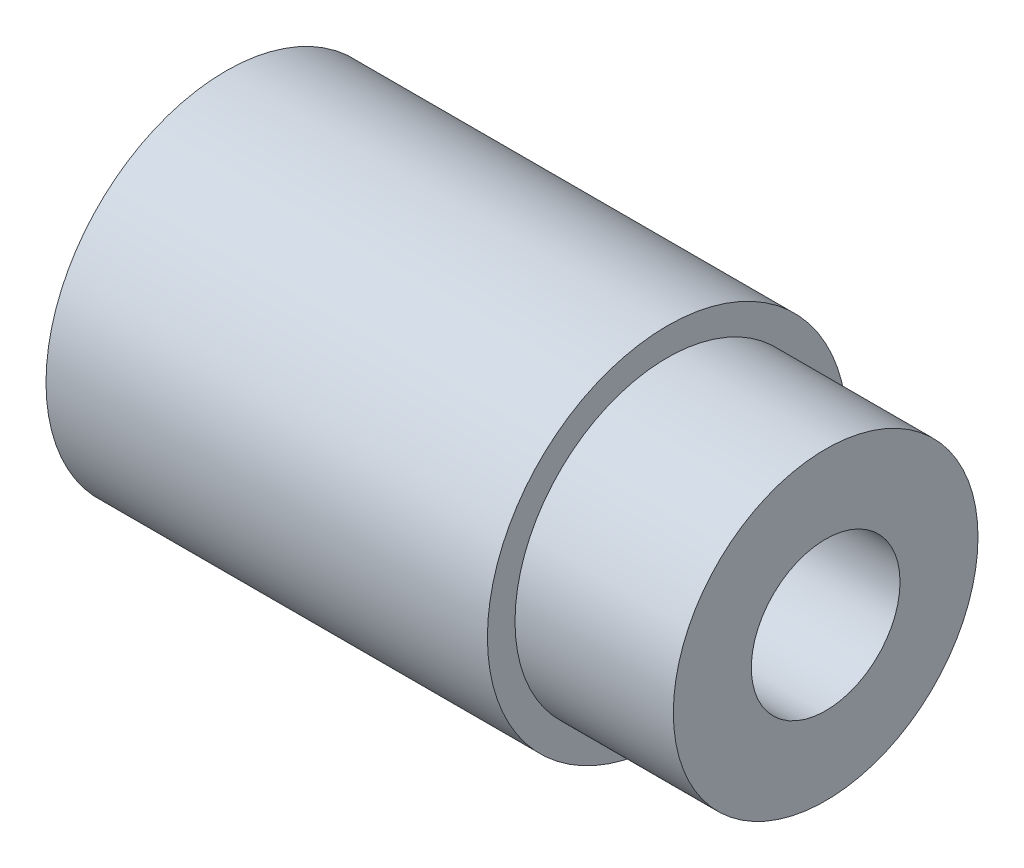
ISO-10303-21;
HEADER;
FILE_DESCRIPTION(('STEP AP214'),'2;1');
FILE_NAME('part.step','',(''),(''),'','','');
FILE_SCHEMA(('AUTOMOTIVE_DESIGN { 1 0 10303 214 1 1 1 1 }'));
ENDSEC;
DATA;
#1=APPLICATION_CONTEXT('core data for automotive mechanical design processes');
#2=APPLICATION_PROTOCOL_DEFINITION('international standard','automotive_design',2000,#1);
#3=PRODUCT_CONTEXT('',#1,'mechanical');
#4=PRODUCT('Part','Part','',(#3));
#5=PRODUCT_RELATED_PRODUCT_CATEGORY('part','',(#4));
#6=PRODUCT_DEFINITION_FORMATION('','',#4);
#7=PRODUCT_DEFINITION_CONTEXT('part definition',#1,'design');
#8=PRODUCT_DEFINITION('design','',#6,#7);
#9=PRODUCT_DEFINITION_SHAPE('','',#8);
#10=(LENGTH_UNIT() NAMED_UNIT(*) SI_UNIT(.MILLI.,.METRE.));
#11=(NAMED_UNIT(*) PLANE_ANGLE_UNIT() SI_UNIT($,.RADIAN.));
#12=(NAMED_UNIT(*) SI_UNIT($,.STERADIAN.) SOLID_ANGLE_UNIT());
#13=UNCERTAINTY_MEASURE_WITH_UNIT(LENGTH_MEASURE(1.E-05),#10,'distance_accuracy_value','');
#14=(GEOMETRIC_REPRESENTATION_CONTEXT(3) GLOBAL_UNCERTAINTY_ASSIGNED_CONTEXT((#13)) GLOBAL_UNIT_ASSIGNED_CONTEXT((#10,
#11,#12)) REPRESENTATION_CONTEXT('',''));
#15=CARTESIAN_POINT('',(0.,0.,0.));
#16=DIRECTION('',(0.,0.,1.));
#17=DIRECTION('',(1.,0.,0.));
#18=AXIS2_PLACEMENT_3D('',#15,#16,#17);
#19=CARTESIAN_POINT('',(-25.,0.,0.));
#20=DIRECTION('',(1.,0.,0.));
#21=DIRECTION('',(0.,0.,-1.));
#22=AXIS2_PLACEMENT_3D('',#19,#20,#21);
#23=CYLINDRICAL_SURFACE('',#22,7.5);
#24=CARTESIAN_POINT('',(-25.,0.,0.));
#25=DIRECTION('',(1.,0.,0.));
#26=DIRECTION('',(0.,0.,-1.));
#27=AXIS2_PLACEMENT_3D('',#24,#25,#26);
#28=CIRCLE('',#27,7.5);
#29=CARTESIAN_POINT('',(-25.,0.,-7.5));
#30=VERTEX_POINT('',#29);
#31=EDGE_CURVE('E11',#30,#30,#28,.T.);
#32=CARTESIAN_POINT('',(-6.6,0.,0.));
#33=DIRECTION('',(0.999999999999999,0.,0.));
#34=DIRECTION('',(0.,0.,-1.));
#35=AXIS2_PLACEMENT_3D('',#32,#33,#34);
#36=CIRCLE('',#35,7.5);
#37=CARTESIAN_POINT('',(-6.6,0.,-7.5));
#38=VERTEX_POINT('',#37);
#39=EDGE_CURVE('E28',#38,#38,#36,.F.);
#40=CARTESIAN_POINT('',(-25.,0.,-7.5));
#41=CARTESIAN_POINT('',(-24.8083333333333,0.,-7.5));
#42=CARTESIAN_POINT('',(-24.6166666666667,0.,-7.5));
#43=CARTESIAN_POINT('',(-24.2333333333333,0.,-7.5));
#44=CARTESIAN_POINT('',(-24.0416666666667,0.,-7.5));
#45=CARTESIAN_POINT('',(-23.6583333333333,0.,-7.5));
#46=CARTESIAN_POINT('',(-23.4666666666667,0.,-7.5));
#47=CARTESIAN_POINT('',(-23.0833333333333,0.,-7.5));
#48=CARTESIAN_POINT('',(-22.8916666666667,0.,-7.5));
#49=CARTESIAN_POINT('',(-22.5083333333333,0.,-7.5));
#50=CARTESIAN_POINT('',(-22.3166666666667,0.,-7.5));
#51=CARTESIAN_POINT('',(-21.9333333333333,0.,-7.5));
#52=CARTESIAN_POINT('',(-21.7416666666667,0.,-7.5));
#53=CARTESIAN_POINT('',(-21.3583333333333,0.,-7.5));
#54=CARTESIAN_POINT('',(-21.1666666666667,0.,-7.5));
#55=CARTESIAN_POINT('',(-20.7833333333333,0.,-7.5));
#56=CARTESIAN_POINT('',(-20.5916666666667,0.,-7.5));
#57=CARTESIAN_POINT('',(-20.2083333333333,0.,-7.5));
#58=CARTESIAN_POINT('',(-20.0166666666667,0.,-7.5));
#59=CARTESIAN_POINT('',(-19.6333333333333,0.,-7.5));
#60=CARTESIAN_POINT('',(-19.4416666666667,0.,-7.5));
#61=CARTESIAN_POINT('',(-19.0583333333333,0.,-7.5));
#62=CARTESIAN_POINT('',(-18.8666666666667,0.,-7.5));
#63=CARTESIAN_POINT('',(-18.4833333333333,0.,-7.5));
#64=CARTESIAN_POINT('',(-18.2916666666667,0.,-7.5));
#65=CARTESIAN_POINT('',(-17.9083333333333,0.,-7.5));
#66=CARTESIAN_POINT('',(-17.7166666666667,0.,-7.5));
#67=CARTESIAN_POINT('',(-17.3333333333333,0.,-7.5));
#68=CARTESIAN_POINT('',(-17.1416666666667,0.,-7.5));
#69=CARTESIAN_POINT('',(-16.7583333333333,0.,-7.5));
#70=CARTESIAN_POINT('',(-16.5666666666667,0.,-7.5));
#71=CARTESIAN_POINT('',(-16.1833333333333,0.,-7.5));
#72=CARTESIAN_POINT('',(-15.9916666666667,0.,-7.5));
#73=CARTESIAN_POINT('',(-15.6083333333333,0.,-7.5));
#74=CARTESIAN_POINT('',(-15.4166666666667,0.,-7.5));
#75=CARTESIAN_POINT('',(-15.0333333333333,0.,-7.5));
#76=CARTESIAN_POINT('',(-14.8416666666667,0.,-7.5));
#77=CARTESIAN_POINT('',(-14.4583333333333,0.,-7.5));
#78=CARTESIAN_POINT('',(-14.2666666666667,0.,-7.5));
#79=CARTESIAN_POINT('',(-13.8833333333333,0.,-7.5));
#80=CARTESIAN_POINT('',(-13.6916666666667,0.,-7.5));
#81=CARTESIAN_POINT('',(-13.3083333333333,0.,-7.5));
#82=CARTESIAN_POINT('',(-13.1166666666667,0.,-7.5));
#83=CARTESIAN_POINT('',(-12.7333333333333,0.,-7.5));
#84=CARTESIAN_POINT('',(-12.5416666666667,0.,-7.5));
#85=CARTESIAN_POINT('',(-12.1583333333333,0.,-7.5));
#86=CARTESIAN_POINT('',(-11.9666666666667,0.,-7.5));
#87=CARTESIAN_POINT('',(-11.5833333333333,0.,-7.5));
#88=CARTESIAN_POINT('',(-11.3916666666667,0.,-7.5));
#89=CARTESIAN_POINT('',(-11.0083333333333,0.,-7.5));
#90=CARTESIAN_POINT('',(-10.8166666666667,0.,-7.5));
#91=CARTESIAN_POINT('',(-10.4333333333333,0.,-7.5));
#92=CARTESIAN_POINT('',(-10.2416666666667,0.,-7.5));
#93=CARTESIAN_POINT('',(-9.85833333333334,0.,-7.5));
#94=CARTESIAN_POINT('',(-9.66666666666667,0.,-7.5));
#95=CARTESIAN_POINT('',(-9.28333333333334,0.,-7.5));
#96=CARTESIAN_POINT('',(-9.09166666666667,0.,-7.5));
#97=CARTESIAN_POINT('',(-8.70833333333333,0.,-7.5));
#98=CARTESIAN_POINT('',(-8.51666666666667,0.,-7.5));
#99=CARTESIAN_POINT('',(-8.13333333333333,0.,-7.5));
#100=CARTESIAN_POINT('',(-7.94166666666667,0.,-7.5));
#101=CARTESIAN_POINT('',(-7.55833333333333,0.,-7.5));
#102=CARTESIAN_POINT('',(-7.36666666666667,0.,-7.5));
#103=CARTESIAN_POINT('',(-6.98333333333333,0.,-7.5));
#104=CARTESIAN_POINT('',(-6.79166666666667,0.,-7.5));
#105=CARTESIAN_POINT('',(-6.6,0.,-7.5));
#106=B_SPLINE_CURVE_WITH_KNOTS('',3,(#40,#41,#42,#43,#44,#45,#46,#47,#48,#49,#50,#51,#52,#53,
#54,#55,#56,#57,#58,#59,#60,#61,#62,#63,#64,#65,#66,#67,#68,#69,#70,#71,#72,#73,#74,#75,#76,#77,
#78,#79,#80,#81,#82,#83,#84,#85,#86,#87,#88,#89,#90,#91,#92,#93,#94,#95,#96,#97,#98,#99,#100,
#101,#102,#103,#104,#105),.UNSPECIFIED.,.F.,.F.,(4,2,2,2,2,2,2,2,2,2,2,2,2,2,2,2,2,2,2,2,2,2,2,
2,2,2,2,2,2,2,2,2,4),(0.,0.574999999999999,1.15,1.725,2.3,2.875,3.44999999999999,
4.02499999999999,4.59999999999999,5.17499999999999,5.74999999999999,6.32499999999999,
6.89999999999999,7.47499999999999,8.04999999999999,8.62499999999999,9.19999999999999,
9.77499999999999,10.35,10.925,11.5,12.075,12.65,13.225,13.8,14.375,14.95,15.525,16.1,16.675,
17.25,17.825,18.4),.UNSPECIFIED.);
#107=EDGE_CURVE('BSEAM25',#30,#38,#106,.T.);
#108=ORIENTED_EDGE('',*,*,#31,.T.);
#109=ORIENTED_EDGE('',*,*,#39,.T.);
#110=ORIENTED_EDGE('',*,*,#107,.T.);
#111=ORIENTED_EDGE('',*,*,#107,.F.);
#112=EDGE_LOOP('',(#108,#110,#109,#111));
#113=FACE_BOUND('',#112,.T.);
#114=ADVANCED_FACE('F25',(#113),#23,.T.);
#115=CARTESIAN_POINT('',(-25.,0.,0.));
#116=DIRECTION('',(1.,0.,0.));
#117=DIRECTION('',(0.,0.,-1.));
#118=AXIS2_PLACEMENT_3D('',#115,#116,#117);
#119=PLANE('',#118);
#120=CARTESIAN_POINT('',(-25.,0.,0.));
#121=DIRECTION('',(1.,0.,0.));
#122=DIRECTION('',(0.,0.,-1.));
#123=AXIS2_PLACEMENT_3D('',#120,#121,#122);
#124=CIRCLE('',#123,3.1);
#125=CARTESIAN_POINT('',(-25.,0.,-3.1));
#126=VERTEX_POINT('',#125);
#127=EDGE_CURVE('E42',#126,#126,#124,.T.);
#128=ORIENTED_EDGE('',*,*,#127,.T.);
#129=EDGE_LOOP('',(#128));
#130=FACE_BOUND('',#129,.T.);
#131=ORIENTED_EDGE('',*,*,#31,.F.);
#132=EDGE_LOOP('',(#131));
#133=FACE_BOUND('',#132,.T.);
#134=ADVANCED_FACE('F66',(#130,#133),#119,.F.);
#135=CARTESIAN_POINT('',(-6.6,0.,0.));
#136=DIRECTION('',(0.999999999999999,0.,0.));
#137=DIRECTION('',(0.,0.,-1.));
#138=AXIS2_PLACEMENT_3D('',#135,#136,#137);
#139=PLANE('',#138);
#140=ORIENTED_EDGE('',*,*,#39,.F.);
#141=EDGE_LOOP('',(#140));
#142=FACE_BOUND('',#141,.T.);
#143=CARTESIAN_POINT('',(-6.6,0.,0.));
#144=DIRECTION('',(1.,0.,0.));
#145=DIRECTION('',(0.,0.,-1.));
#146=AXIS2_PLACEMENT_3D('',#143,#144,#145);
#147=CIRCLE('',#146,6.35);
#148=CARTESIAN_POINT('',(-6.6,0.,-6.35));
#149=VERTEX_POINT('',#148);
#150=EDGE_CURVE('E35',#149,#149,#147,.T.);
#151=ORIENTED_EDGE('',*,*,#150,.F.);
#152=EDGE_LOOP('',(#151));
#153=FACE_BOUND('',#152,.T.);
#154=ADVANCED_FACE('F59',(#142,#153),#139,.T.);
#155=CARTESIAN_POINT('',(-6.6,0.,0.));
#156=DIRECTION('',(1.,0.,0.));
#157=DIRECTION('',(0.,0.,-1.));
#158=AXIS2_PLACEMENT_3D('',#155,#156,#157);
#159=CYLINDRICAL_SURFACE('',#158,6.35);
#160=CARTESIAN_POINT('',(0.,0.,0.));
#161=DIRECTION('',(1.,0.,0.));
#162=DIRECTION('',(0.,0.,-1.));
#163=AXIS2_PLACEMENT_3D('',#160,#161,#162);
#164=CIRCLE('',#163,6.35);
#165=CARTESIAN_POINT('',(0.,0.,-6.35));
#166=VERTEX_POINT('',#165);
#167=EDGE_CURVE('E39',#166,#166,#164,.T.);
#168=CARTESIAN_POINT('',(-6.6,0.,-6.35));
#169=CARTESIAN_POINT('',(-6.53125,0.,-6.35));
#170=CARTESIAN_POINT('',(-6.4625,0.,-6.35));
#171=CARTESIAN_POINT('',(-6.325,0.,-6.35));
#172=CARTESIAN_POINT('',(-6.25625,0.,-6.35));
#173=CARTESIAN_POINT('',(-6.11875,0.,-6.35));
#174=CARTESIAN_POINT('',(-6.05,0.,-6.35));
#175=CARTESIAN_POINT('',(-5.9125,0.,-6.35));
#176=CARTESIAN_POINT('',(-5.84375,0.,-6.35));
#177=CARTESIAN_POINT('',(-5.70625,0.,-6.35));
#178=CARTESIAN_POINT('',(-5.6375,0.,-6.35));
#179=CARTESIAN_POINT('',(-5.5,0.,-6.35));
#180=CARTESIAN_POINT('',(-5.43125,0.,-6.35));
#181=CARTESIAN_POINT('',(-5.29375,0.,-6.35));
#182=CARTESIAN_POINT('',(-5.225,0.,-6.35));
#183=CARTESIAN_POINT('',(-5.0875,0.,-6.35));
#184=CARTESIAN_POINT('',(-5.01875,0.,-6.35));
#185=CARTESIAN_POINT('',(-4.88125,0.,-6.35));
#186=CARTESIAN_POINT('',(-4.8125,0.,-6.35));
#187=CARTESIAN_POINT('',(-4.675,0.,-6.35));
#188=CARTESIAN_POINT('',(-4.60625,0.,-6.35));
#189=CARTESIAN_POINT('',(-4.46875,0.,-6.35));
#190=CARTESIAN_POINT('',(-4.4,0.,-6.35));
#191=CARTESIAN_POINT('',(-4.2625,0.,-6.35));
#192=CARTESIAN_POINT('',(-4.19375,0.,-6.35));
#193=CARTESIAN_POINT('',(-4.05625,0.,-6.35));
#194=CARTESIAN_POINT('',(-3.9875,0.,-6.35));
#195=CARTESIAN_POINT('',(-3.85,0.,-6.35));
#196=CARTESIAN_POINT('',(-3.78125,0.,-6.35));
#197=CARTESIAN_POINT('',(-3.64375,0.,-6.35));
#198=CARTESIAN_POINT('',(-3.575,0.,-6.35));
#199=CARTESIAN_POINT('',(-3.4375,0.,-6.35));
#200=CARTESIAN_POINT('',(-3.36875,0.,-6.35));
#201=CARTESIAN_POINT('',(-3.23125,0.,-6.35));
#202=CARTESIAN_POINT('',(-3.1625,0.,-6.35));
#203=CARTESIAN_POINT('',(-3.025,0.,-6.35));
#204=CARTESIAN_POINT('',(-2.95625,0.,-6.35));
#205=CARTESIAN_POINT('',(-2.81875,0.,-6.35));
#206=CARTESIAN_POINT('',(-2.75,0.,-6.35));
#207=CARTESIAN_POINT('',(-2.6125,0.,-6.35));
#208=CARTESIAN_POINT('',(-2.54375,0.,-6.35));
#209=CARTESIAN_POINT('',(-2.40625,0.,-6.35));
#210=CARTESIAN_POINT('',(-2.3375,0.,-6.35));
#211=CARTESIAN_POINT('',(-2.2,0.,-6.35));
#212=CARTESIAN_POINT('',(-2.13125,0.,-6.35));
#213=CARTESIAN_POINT('',(-1.99375,0.,-6.35));
#214=CARTESIAN_POINT('',(-1.925,0.,-6.35));
#215=CARTESIAN_POINT('',(-1.7875,0.,-6.35));
#216=CARTESIAN_POINT('',(-1.71875,0.,-6.35));
#217=CARTESIAN_POINT('',(-1.58125,0.,-6.35));
#218=CARTESIAN_POINT('',(-1.5125,0.,-6.35));
#219=CARTESIAN_POINT('',(-1.375,0.,-6.35));
#220=CARTESIAN_POINT('',(-1.30625,0.,-6.35));
#221=CARTESIAN_POINT('',(-1.16875,0.,-6.35));
#222=CARTESIAN_POINT('',(-1.1,0.,-6.35));
#223=CARTESIAN_POINT('',(-0.962499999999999,0.,-6.35));
#224=CARTESIAN_POINT('',(-0.893749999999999,0.,-6.35));
#225=CARTESIAN_POINT('',(-0.756249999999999,0.,-6.35));
#226=CARTESIAN_POINT('',(-0.687499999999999,0.,-6.35));
#227=CARTESIAN_POINT('',(-0.549999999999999,0.,-6.35));
#228=CARTESIAN_POINT('',(-0.481249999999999,0.,-6.35));
#229=CARTESIAN_POINT('',(-0.343749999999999,0.,-6.35));
#230=CARTESIAN_POINT('',(-0.274999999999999,0.,-6.35));
#231=CARTESIAN_POINT('',(-0.137499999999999,0.,-6.35));
#232=CARTESIAN_POINT('',(-0.0687499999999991,0.,-6.35));
#233=CARTESIAN_POINT('',(0.,0.,-6.35));
#234=B_SPLINE_CURVE_WITH_KNOTS('',3,(#168,#169,#170,#171,#172,#173,#174,#175,#176,#177,#178,
#179,#180,#181,#182,#183,#184,#185,#186,#187,#188,#189,#190,#191,#192,#193,#194,#195,#196,#197,
#198,#199,#200,#201,#202,#203,#204,#205,#206,#207,#208,#209,#210,#211,#212,#213,#214,#215,#216,
#217,#218,#219,#220,#221,#222,#223,#224,#225,#226,#227,#228,#229,#230,#231,#232,#233),
.UNSPECIFIED.,.F.,.F.,(4,2,2,2,2,2,2,2,2,2,2,2,2,2,2,2,2,2,2,2,2,2,2,2,2,2,2,2,2,2,2,2,4),(0.,
0.20625,0.4125,0.618749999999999,0.824999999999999,1.03125,1.2375,1.44375,1.65,1.85625,2.0625,
2.26875,2.475,2.68125,2.8875,3.09375,3.3,3.50625,3.7125,3.91875,4.125,4.33125,4.5375,4.74375,
4.95,5.15625,5.3625,5.56875,5.775,5.98125,6.1875,6.39375,6.6),.UNSPECIFIED.);
#235=EDGE_CURVE('BSEAM54',#149,#166,#234,.T.);
#236=ORIENTED_EDGE('',*,*,#150,.T.);
#237=ORIENTED_EDGE('',*,*,#167,.F.);
#238=ORIENTED_EDGE('',*,*,#235,.T.);
#239=ORIENTED_EDGE('',*,*,#235,.F.);
#240=EDGE_LOOP('',(#236,#238,#237,#239));
#241=FACE_BOUND('',#240,.T.);
#242=ADVANCED_FACE('F54',(#241),#159,.T.);
#243=CARTESIAN_POINT('',(0.,0.,0.));
#244=DIRECTION('',(1.,0.,0.));
#245=DIRECTION('',(0.,0.,-1.));
#246=AXIS2_PLACEMENT_3D('',#243,#244,#245);
#247=PLANE('',#246);
#248=CARTESIAN_POINT('',(0.,0.,0.));
#249=DIRECTION('',(1.,0.,0.));
#250=DIRECTION('',(0.,0.,-1.));
#251=AXIS2_PLACEMENT_3D('',#248,#249,#250);
#252=CIRCLE('',#251,3.1);
#253=CARTESIAN_POINT('',(0.,0.,-3.1));
#254=VERTEX_POINT('',#253);
#255=EDGE_CURVE('E45',#254,#254,#252,.T.);
#256=ORIENTED_EDGE('',*,*,#255,.F.);
#257=EDGE_LOOP('',(#256));
#258=FACE_BOUND('',#257,.T.);
#259=ORIENTED_EDGE('',*,*,#167,.T.);
#260=EDGE_LOOP('',(#259));
#261=FACE_BOUND('',#260,.T.);
#262=ADVANCED_FACE('F51',(#258,#261),#247,.T.);
#263=CARTESIAN_POINT('',(-25.,0.,0.));
#264=DIRECTION('',(1.,0.,0.));
#265=DIRECTION('',(0.,0.,-1.));
#266=AXIS2_PLACEMENT_3D('',#263,#264,#265);
#267=CYLINDRICAL_SURFACE('',#266,3.1);
#268=CARTESIAN_POINT('',(-25.,0.,-3.1));
#269=CARTESIAN_POINT('',(-24.7395833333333,0.,-3.1));
#270=CARTESIAN_POINT('',(-24.4791666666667,0.,-3.1));
#271=CARTESIAN_POINT('',(-23.9583333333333,0.,-3.1));
#272=CARTESIAN_POINT('',(-23.6979166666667,0.,-3.1));
#273=CARTESIAN_POINT('',(-23.1770833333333,0.,-3.1));
#274=CARTESIAN_POINT('',(-22.9166666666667,0.,-3.1));
#275=CARTESIAN_POINT('',(-22.3958333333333,0.,-3.1));
#276=CARTESIAN_POINT('',(-22.1354166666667,0.,-3.1));
#277=CARTESIAN_POINT('',(-21.6145833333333,0.,-3.1));
#278=CARTESIAN_POINT('',(-21.3541666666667,0.,-3.1));
#279=CARTESIAN_POINT('',(-20.8333333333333,0.,-3.1));
#280=CARTESIAN_POINT('',(-20.5729166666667,0.,-3.1));
#281=CARTESIAN_POINT('',(-20.0520833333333,0.,-3.1));
#282=CARTESIAN_POINT('',(-19.7916666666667,0.,-3.1));
#283=CARTESIAN_POINT('',(-19.2708333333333,0.,-3.1));
#284=CARTESIAN_POINT('',(-19.0104166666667,0.,-3.1));
#285=CARTESIAN_POINT('',(-18.4895833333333,0.,-3.1));
#286=CARTESIAN_POINT('',(-18.2291666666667,0.,-3.1));
#287=CARTESIAN_POINT('',(-17.7083333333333,0.,-3.1));
#288=CARTESIAN_POINT('',(-17.4479166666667,0.,-3.1));
#289=CARTESIAN_POINT('',(-16.9270833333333,0.,-3.1));
#290=CARTESIAN_POINT('',(-16.6666666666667,0.,-3.1));
#291=CARTESIAN_POINT('',(-16.1458333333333,0.,-3.1));
#292=CARTESIAN_POINT('',(-15.8854166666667,0.,-3.1));
#293=CARTESIAN_POINT('',(-15.3645833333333,0.,-3.1));
#294=CARTESIAN_POINT('',(-15.1041666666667,0.,-3.1));
#295=CARTESIAN_POINT('',(-14.5833333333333,0.,-3.1));
#296=CARTESIAN_POINT('',(-14.3229166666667,0.,-3.1));
#297=CARTESIAN_POINT('',(-13.8020833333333,0.,-3.1));
#298=CARTESIAN_POINT('',(-13.5416666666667,0.,-3.1));
#299=CARTESIAN_POINT('',(-13.0208333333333,0.,-3.1));
#300=CARTESIAN_POINT('',(-12.7604166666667,0.,-3.1));
#301=CARTESIAN_POINT('',(-12.2395833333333,0.,-3.1));
#302=CARTESIAN_POINT('',(-11.9791666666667,0.,-3.1));
#303=CARTESIAN_POINT('',(-11.4583333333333,0.,-3.1));
#304=CARTESIAN_POINT('',(-11.1979166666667,0.,-3.1));
#305=CARTESIAN_POINT('',(-10.6770833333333,0.,-3.1));
#306=CARTESIAN_POINT('',(-10.4166666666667,0.,-3.1));
#307=CARTESIAN_POINT('',(-9.89583333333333,0.,-3.1));
#308=CARTESIAN_POINT('',(-9.63541666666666,0.,-3.1));
#309=CARTESIAN_POINT('',(-9.11458333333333,0.,-3.1));
#310=CARTESIAN_POINT('',(-8.85416666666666,0.,-3.1));
#311=CARTESIAN_POINT('',(-8.33333333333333,0.,-3.1));
#312=CARTESIAN_POINT('',(-8.07291666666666,0.,-3.1));
#313=CARTESIAN_POINT('',(-7.55208333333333,0.,-3.1));
#314=CARTESIAN_POINT('',(-7.29166666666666,0.,-3.1));
#315=CARTESIAN_POINT('',(-6.77083333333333,0.,-3.1));
#316=CARTESIAN_POINT('',(-6.51041666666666,0.,-3.1));
#317=CARTESIAN_POINT('',(-5.98958333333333,0.,-3.1));
#318=CARTESIAN_POINT('',(-5.72916666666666,0.,-3.1));
#319=CARTESIAN_POINT('',(-5.20833333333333,0.,-3.1));
#320=CARTESIAN_POINT('',(-4.94791666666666,0.,-3.1));
#321=CARTESIAN_POINT('',(-4.42708333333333,0.,-3.1));
#322=CARTESIAN_POINT('',(-4.16666666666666,0.,-3.1));
#323=CARTESIAN_POINT('',(-3.64583333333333,0.,-3.1));
#324=CARTESIAN_POINT('',(-3.38541666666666,0.,-3.1));
#325=CARTESIAN_POINT('',(-2.86458333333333,0.,-3.1));
#326=CARTESIAN_POINT('',(-2.60416666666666,0.,-3.1));
#327=CARTESIAN_POINT('',(-2.08333333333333,0.,-3.1));
#328=CARTESIAN_POINT('',(-1.82291666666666,0.,-3.1));
#329=CARTESIAN_POINT('',(-1.30208333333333,0.,-3.1));
#330=CARTESIAN_POINT('',(-1.04166666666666,0.,-3.1));
#331=CARTESIAN_POINT('',(-0.52083333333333,0.,-3.1));
#332=CARTESIAN_POINT('',(-0.260416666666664,0.,-3.1));
#333=CARTESIAN_POINT('',(0.,0.,-3.1));
#334=B_SPLINE_CURVE_WITH_KNOTS('',3,(#268,#269,#270,#271,#272,#273,#274,#275,#276,#277,#278,
#279,#280,#281,#282,#283,#284,#285,#286,#287,#288,#289,#290,#291,#292,#293,#294,#295,#296,#297,
#298,#299,#300,#301,#302,#303,#304,#305,#306,#307,#308,#309,#310,#311,#312,#313,#314,#315,#316,
#317,#318,#319,#320,#321,#322,#323,#324,#325,#326,#327,#328,#329,#330,#331,#332,#333),
.UNSPECIFIED.,.F.,.F.,(4,2,2,2,2,2,2,2,2,2,2,2,2,2,2,2,2,2,2,2,2,2,2,2,2,2,2,2,2,2,2,2,4),(0.,
0.781250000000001,1.5625,2.34375,3.125,3.90625,4.6875,5.46875,6.25,7.03125,7.8125,8.59375,9.375,
10.15625,10.9375,11.71875,12.5,13.28125,14.0625,14.84375,15.625,16.40625,17.1875,17.96875,18.75,
19.53125,20.3125,21.09375,21.875,22.65625,23.4375,24.21875,25.),.UNSPECIFIED.);
#335=EDGE_CURVE('BSEAM49',#126,#254,#334,.T.);
#336=ORIENTED_EDGE('',*,*,#127,.F.);
#337=ORIENTED_EDGE('',*,*,#255,.T.);
#338=ORIENTED_EDGE('',*,*,#335,.T.);
#339=ORIENTED_EDGE('',*,*,#335,.F.);
#340=EDGE_LOOP('',(#336,#338,#337,#339));
#341=FACE_BOUND('',#340,.T.);
#342=ADVANCED_FACE('F49',(#341),#267,.F.);
#343=CLOSED_SHELL('',(#114,#134,#154,#242,#262,#342));
#344=MANIFOLD_SOLID_BREP('B2',#343);
#345=ADVANCED_BREP_SHAPE_REPRESENTATION('',(#18,#344),#14);
#346=SHAPE_DEFINITION_REPRESENTATION(#9,#345);
ENDSEC;
END-ISO-10303-21;
